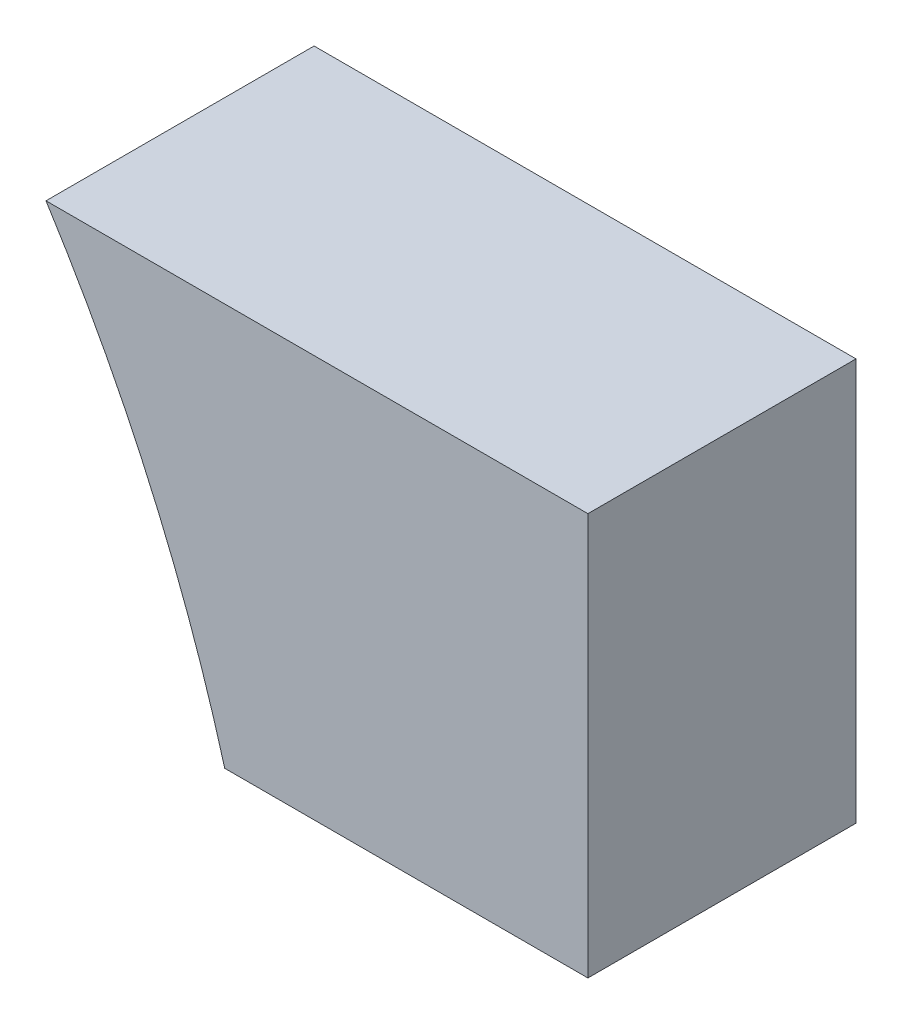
from build123d import *

# Parameters (mm, degrees)
EXTRUSION1_DEPTH = 20


with BuildPart() as part:
    # Esquisse1 → Extrusion1 (new body)
    with BuildSketch(Plane.XY):
        with BuildLine():
            Line((94.57272334, 60), (135, 60))
            Line((135, 60), (135, 30))
            Line((135, 30), (107.907367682, 30))
            ThreePointArc((107.907367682, 30), (102.345233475, 45.491242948), (94.57272334, 60))
        make_face()
    extrude(amount=EXTRUSION1_DEPTH)


solid = part.part
